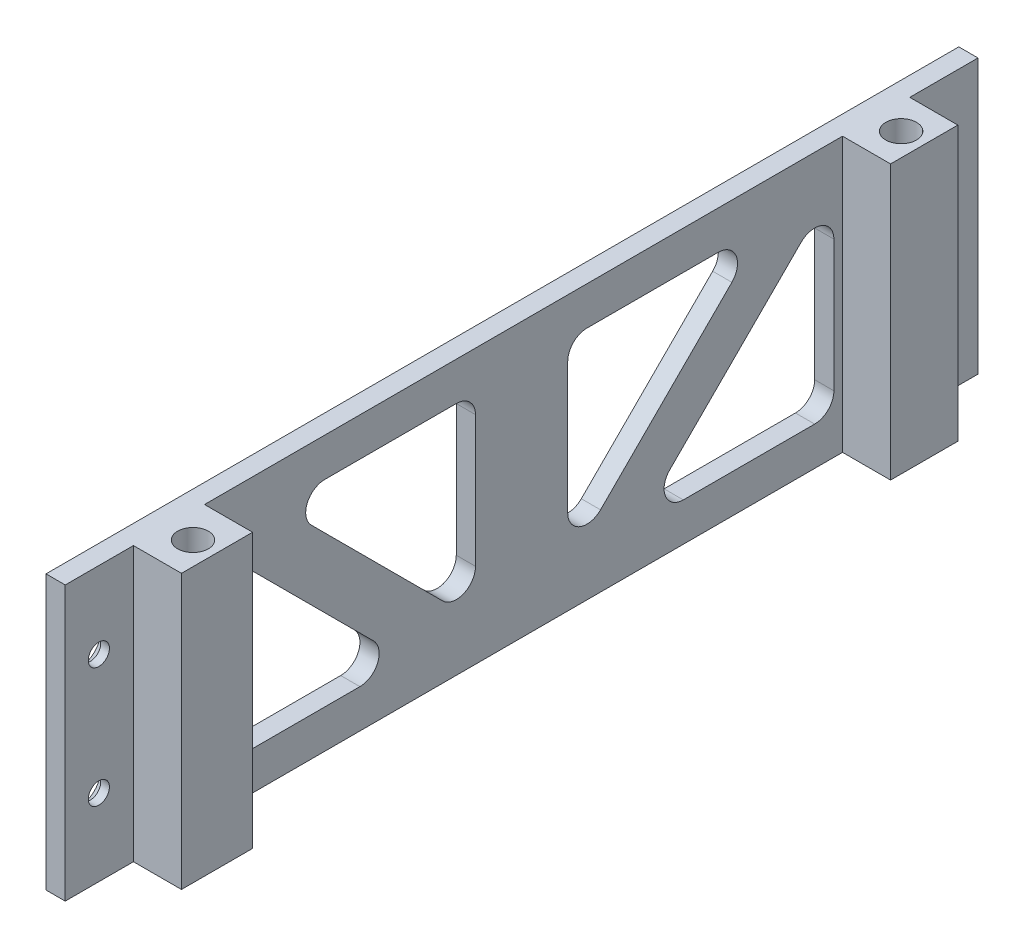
ISO-10303-21;
HEADER;
FILE_DESCRIPTION(('STEP AP214'),'2;1');
FILE_NAME('part.step','',(''),(''),'','','');
FILE_SCHEMA(('AUTOMOTIVE_DESIGN { 1 0 10303 214 1 1 1 1 }'));
ENDSEC;
DATA;
#1=APPLICATION_CONTEXT('core data for automotive mechanical design processes');
#2=APPLICATION_PROTOCOL_DEFINITION('international standard','automotive_design',2000,#1);
#3=PRODUCT_CONTEXT('',#1,'mechanical');
#4=PRODUCT('Part','Part','',(#3));
#5=PRODUCT_RELATED_PRODUCT_CATEGORY('part','',(#4));
#6=PRODUCT_DEFINITION_FORMATION('','',#4);
#7=PRODUCT_DEFINITION_CONTEXT('part definition',#1,'design');
#8=PRODUCT_DEFINITION('design','',#6,#7);
#9=PRODUCT_DEFINITION_SHAPE('','',#8);
#10=(LENGTH_UNIT() NAMED_UNIT(*) SI_UNIT(.MILLI.,.METRE.));
#11=(NAMED_UNIT(*) PLANE_ANGLE_UNIT() SI_UNIT($,.RADIAN.));
#12=(NAMED_UNIT(*) SI_UNIT($,.STERADIAN.) SOLID_ANGLE_UNIT());
#13=UNCERTAINTY_MEASURE_WITH_UNIT(LENGTH_MEASURE(1.E-05),#10,'distance_accuracy_value','');
#14=(GEOMETRIC_REPRESENTATION_CONTEXT(3) GLOBAL_UNCERTAINTY_ASSIGNED_CONTEXT((#13)) GLOBAL_UNIT_ASSIGNED_CONTEXT((#10,
#11,#12)) REPRESENTATION_CONTEXT('',''));
#15=CARTESIAN_POINT('',(0.,0.,0.));
#16=DIRECTION('',(0.,0.,1.));
#17=DIRECTION('',(1.,0.,0.));
#18=AXIS2_PLACEMENT_3D('',#15,#16,#17);
#19=CARTESIAN_POINT('',(2.,0.,0.));
#20=DIRECTION('',(-1.,0.,0.));
#21=DIRECTION('',(0.,0.,1.));
#22=AXIS2_PLACEMENT_3D('',#19,#20,#21);
#23=PLANE('',#22);
#24=CARTESIAN_POINT('',(2.,8.25000000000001,6.7999999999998));
#25=DIRECTION('',(-1.,0.,0.));
#26=DIRECTION('',(0.,0.,1.));
#27=AXIS2_PLACEMENT_3D('',#24,#25,#26);
#28=CIRCLE('',#27,2.);
#29=CARTESIAN_POINT('',(2.,8.25000000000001,4.7999999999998));
#30=VERTEX_POINT('',#29);
#31=CARTESIAN_POINT('',(2.,10.25,6.7999999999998));
#32=VERTEX_POINT('',#31);
#33=EDGE_CURVE('E358',#30,#32,#28,.F.);
#34=ORIENTED_EDGE('',*,*,#33,.F.);
#35=DIRECTION('',(0.,1.,0.));
#36=VECTOR('',#35,1.);
#37=CARTESIAN_POINT('',(2.,0.,4.79999999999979));
#38=LINE('',#37,#36);
#39=CARTESIAN_POINT('',(2.,-5.42157287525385,4.79999999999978));
#40=VERTEX_POINT('',#39);
#41=EDGE_CURVE('E337',#40,#30,#38,.T.);
#42=ORIENTED_EDGE('',*,*,#41,.F.);
#43=CARTESIAN_POINT('',(2.,-5.42157287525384,6.7999999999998));
#44=DIRECTION('',(-1.,0.,0.));
#45=DIRECTION('',(0.,0.,1.));
#46=AXIS2_PLACEMENT_3D('',#43,#44,#45);
#47=CIRCLE('',#46,2.00000000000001);
#48=CARTESIAN_POINT('',(2.,-6.83578643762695,8.21421356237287));
#49=VERTEX_POINT('',#48);
#50=EDGE_CURVE('E349',#49,#40,#47,.F.);
#51=ORIENTED_EDGE('',*,*,#50,.F.);
#52=DIRECTION('',(0.,-0.707106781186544,-0.707106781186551));
#53=VECTOR('',#52,1.);
#54=CARTESIAN_POINT('',(2.,-7.52499999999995,7.52499999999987));
#55=LINE('',#54,#53);
#56=CARTESIAN_POINT('',(2.,6.83578643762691,21.8857864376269));
#57=VERTEX_POINT('',#56);
#58=EDGE_CURVE('E352',#57,#49,#55,.T.);
#59=ORIENTED_EDGE('',*,*,#58,.F.);
#60=CARTESIAN_POINT('',(2.,8.25000000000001,20.4715728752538));
#61=DIRECTION('',(-1.,0.,0.));
#62=DIRECTION('',(0.,0.,1.));
#63=AXIS2_PLACEMENT_3D('',#60,#61,#62);
#64=CIRCLE('',#63,2.);
#65=CARTESIAN_POINT('',(2.,10.25,20.4715728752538));
#66=VERTEX_POINT('',#65);
#67=EDGE_CURVE('E354',#66,#57,#64,.F.);
#68=ORIENTED_EDGE('',*,*,#67,.F.);
#69=DIRECTION('',(0.,0.,1.));
#70=VECTOR('',#69,1.);
#71=CARTESIAN_POINT('',(2.,10.25,0.));
#72=LINE('',#71,#70);
#73=EDGE_CURVE('E356',#32,#66,#72,.T.);
#74=ORIENTED_EDGE('',*,*,#73,.F.);
#75=EDGE_LOOP('',(#34,#42,#51,#59,#68,#74));
#76=FACE_BOUND('',#75,.T.);
#77=DIRECTION('',(0.,0.,1.));
#78=VECTOR('',#77,1.);
#79=CARTESIAN_POINT('',(2.,-10.25,0.));
#80=LINE('',#79,#78);
#81=CARTESIAN_POINT('',(2.,-10.25,-30.5));
#82=VERTEX_POINT('',#81);
#83=CARTESIAN_POINT('',(2.,-10.25,-16.8284271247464));
#84=VERTEX_POINT('',#83);
#85=EDGE_CURVE('E402',#82,#84,#80,.T.);
#86=ORIENTED_EDGE('',*,*,#85,.T.);
#87=CARTESIAN_POINT('',(2.,-8.25,-16.8284271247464));
#88=DIRECTION('',(-1.,0.,0.));
#89=DIRECTION('',(0.,0.,1.));
#90=AXIS2_PLACEMENT_3D('',#87,#88,#89);
#91=CIRCLE('',#90,2.);
#92=CARTESIAN_POINT('',(2.,-6.83578643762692,-15.4142135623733));
#93=VERTEX_POINT('',#92);
#94=EDGE_CURVE('E405',#84,#93,#91,.T.);
#95=ORIENTED_EDGE('',*,*,#94,.T.);
#96=DIRECTION('',(0.,0.707106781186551,-0.707106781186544));
#97=VECTOR('',#96,1.);
#98=CARTESIAN_POINT('',(2.,-11.1250000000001,-11.1250000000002));
#99=LINE('',#98,#97);
#100=CARTESIAN_POINT('',(2.,6.83578643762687,-29.0857864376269));
#101=VERTEX_POINT('',#100);
#102=EDGE_CURVE('E380',#93,#101,#99,.T.);
#103=ORIENTED_EDGE('',*,*,#102,.T.);
#104=CARTESIAN_POINT('',(2.,5.42157287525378,-30.5));
#105=DIRECTION('',(-1.,0.,0.));
#106=DIRECTION('',(0.,0.,1.));
#107=AXIS2_PLACEMENT_3D('',#104,#105,#106);
#108=CIRCLE('',#107,2.);
#109=CARTESIAN_POINT('',(2.,5.42157287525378,-32.5));
#110=VERTEX_POINT('',#109);
#111=EDGE_CURVE('E393',#101,#110,#108,.T.);
#112=ORIENTED_EDGE('',*,*,#111,.T.);
#113=DIRECTION('',(0.,-1.,0.));
#114=VECTOR('',#113,1.);
#115=CARTESIAN_POINT('',(2.,0.,-32.5));
#116=LINE('',#115,#114);
#117=CARTESIAN_POINT('',(2.,-8.25,-32.5));
#118=VERTEX_POINT('',#117);
#119=EDGE_CURVE('E396',#110,#118,#116,.T.);
#120=ORIENTED_EDGE('',*,*,#119,.T.);
#121=CARTESIAN_POINT('',(2.,-8.25,-30.5));
#122=DIRECTION('',(-1.,0.,0.));
#123=DIRECTION('',(0.,0.,1.));
#124=AXIS2_PLACEMENT_3D('',#121,#122,#123);
#125=CIRCLE('',#124,2.);
#126=EDGE_CURVE('E399',#118,#82,#125,.T.);
#127=ORIENTED_EDGE('',*,*,#126,.T.);
#128=EDGE_LOOP('',(#86,#95,#103,#112,#120,#127));
#129=FACE_BOUND('',#128,.T.);
#130=DIRECTION('',(0.,1.,0.));
#131=VECTOR('',#130,1.);
#132=CARTESIAN_POINT('',(2.,0.,-4.79999999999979));
#133=LINE('',#132,#131);
#134=CARTESIAN_POINT('',(2.,-5.42157287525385,-4.79999999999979));
#135=VERTEX_POINT('',#134);
#136=CARTESIAN_POINT('',(2.,8.25000000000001,-4.7999999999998));
#137=VERTEX_POINT('',#136);
#138=EDGE_CURVE('E450',#135,#137,#133,.T.);
#139=ORIENTED_EDGE('',*,*,#138,.T.);
#140=CARTESIAN_POINT('',(2.,8.25000000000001,-6.7999999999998));
#141=DIRECTION('',(-1.,0.,0.));
#142=DIRECTION('',(0.,0.,1.));
#143=AXIS2_PLACEMENT_3D('',#140,#141,#142);
#144=CIRCLE('',#143,2.);
#145=CARTESIAN_POINT('',(2.,10.25,-6.7999999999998));
#146=VERTEX_POINT('',#145);
#147=EDGE_CURVE('E453',#137,#146,#144,.T.);
#148=ORIENTED_EDGE('',*,*,#147,.T.);
#149=DIRECTION('',(0.,0.,-1.));
#150=VECTOR('',#149,1.);
#151=CARTESIAN_POINT('',(2.,10.25,0.));
#152=LINE('',#151,#150);
#153=CARTESIAN_POINT('',(2.,10.25,-20.4715728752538));
#154=VERTEX_POINT('',#153);
#155=EDGE_CURVE('E428',#146,#154,#152,.T.);
#156=ORIENTED_EDGE('',*,*,#155,.T.);
#157=CARTESIAN_POINT('',(2.,8.25000000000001,-20.4715728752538));
#158=DIRECTION('',(-1.,0.,0.));
#159=DIRECTION('',(0.,0.,1.));
#160=AXIS2_PLACEMENT_3D('',#157,#158,#159);
#161=CIRCLE('',#160,2.);
#162=CARTESIAN_POINT('',(2.,6.83578643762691,-21.8857864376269));
#163=VERTEX_POINT('',#162);
#164=EDGE_CURVE('E441',#154,#163,#161,.T.);
#165=ORIENTED_EDGE('',*,*,#164,.T.);
#166=DIRECTION('',(0.,-0.707106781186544,0.707106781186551));
#167=VECTOR('',#166,1.);
#168=CARTESIAN_POINT('',(2.,-7.52499999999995,-7.52499999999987));
#169=LINE('',#168,#167);
#170=CARTESIAN_POINT('',(2.,-6.83578643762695,-8.21421356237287));
#171=VERTEX_POINT('',#170);
#172=EDGE_CURVE('E444',#163,#171,#169,.T.);
#173=ORIENTED_EDGE('',*,*,#172,.T.);
#174=CARTESIAN_POINT('',(2.,-5.42157287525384,-6.7999999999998));
#175=DIRECTION('',(-1.,0.,0.));
#176=DIRECTION('',(0.,0.,1.));
#177=AXIS2_PLACEMENT_3D('',#174,#175,#176);
#178=CIRCLE('',#177,2.00000000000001);
#179=EDGE_CURVE('E447',#171,#135,#178,.T.);
#180=ORIENTED_EDGE('',*,*,#179,.T.);
#181=EDGE_LOOP('',(#139,#148,#156,#165,#173,#180));
#182=FACE_BOUND('',#181,.T.);
#183=DIRECTION('',(0.,-1.,0.));
#184=VECTOR('',#183,1.);
#185=CARTESIAN_POINT('',(2.,14.25,-33.4));
#186=LINE('',#185,#184);
#187=CARTESIAN_POINT('',(2.,14.25,-33.4));
#188=VERTEX_POINT('',#187);
#189=CARTESIAN_POINT('',(2.,-14.25,-33.4));
#190=VERTEX_POINT('',#189);
#191=EDGE_CURVE('E505',#188,#190,#186,.T.);
#192=ORIENTED_EDGE('',*,*,#191,.F.);
#193=DIRECTION('',(0.,0.,1.));
#194=VECTOR('',#193,1.);
#195=CARTESIAN_POINT('',(2.,14.25,-47.5));
#196=LINE('',#195,#194);
#197=CARTESIAN_POINT('',(2.,14.25,33.));
#198=VERTEX_POINT('',#197);
#199=EDGE_CURVE('E555',#188,#198,#196,.T.);
#200=ORIENTED_EDGE('',*,*,#199,.T.);
#201=DIRECTION('',(0.,1.,0.));
#202=VECTOR('',#201,1.);
#203=CARTESIAN_POINT('',(2.,-14.25,33.));
#204=LINE('',#203,#202);
#205=CARTESIAN_POINT('',(2.,-14.25,33.));
#206=VERTEX_POINT('',#205);
#207=EDGE_CURVE('E533',#206,#198,#204,.T.);
#208=ORIENTED_EDGE('',*,*,#207,.F.);
#209=DIRECTION('',(0.,0.,-1.));
#210=VECTOR('',#209,1.);
#211=CARTESIAN_POINT('',(2.,-14.25,-47.5));
#212=LINE('',#211,#210);
#213=EDGE_CURVE('E574',#206,#190,#212,.T.);
#214=ORIENTED_EDGE('',*,*,#213,.T.);
#215=EDGE_LOOP('',(#192,#200,#208,#214));
#216=FACE_BOUND('',#215,.T.);
#217=CARTESIAN_POINT('',(2.,-8.25,16.8284271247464));
#218=DIRECTION('',(-1.,0.,0.));
#219=DIRECTION('',(0.,0.,1.));
#220=AXIS2_PLACEMENT_3D('',#217,#218,#219);
#221=CIRCLE('',#220,2.);
#222=CARTESIAN_POINT('',(2.,-10.25,16.8284271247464));
#223=VERTEX_POINT('',#222);
#224=CARTESIAN_POINT('',(2.,-6.83578643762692,15.4142135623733));
#225=VERTEX_POINT('',#224);
#226=EDGE_CURVE('E314',#223,#225,#221,.F.);
#227=ORIENTED_EDGE('',*,*,#226,.F.);
#228=DIRECTION('',(0.,0.,-1.));
#229=VECTOR('',#228,1.);
#230=CARTESIAN_POINT('',(2.,-10.25,0.));
#231=LINE('',#230,#229);
#232=CARTESIAN_POINT('',(2.,-10.25,30.5));
#233=VERTEX_POINT('',#232);
#234=EDGE_CURVE('E299',#233,#223,#231,.T.);
#235=ORIENTED_EDGE('',*,*,#234,.F.);
#236=CARTESIAN_POINT('',(2.,-8.25,30.5));
#237=DIRECTION('',(-1.,0.,0.));
#238=DIRECTION('',(0.,0.,1.));
#239=AXIS2_PLACEMENT_3D('',#236,#237,#238);
#240=CIRCLE('',#239,2.);
#241=CARTESIAN_POINT('',(2.,-8.25,32.5));
#242=VERTEX_POINT('',#241);
#243=EDGE_CURVE('E274',#242,#233,#240,.F.);
#244=ORIENTED_EDGE('',*,*,#243,.F.);
#245=DIRECTION('',(0.,-1.,0.));
#246=VECTOR('',#245,1.);
#247=CARTESIAN_POINT('',(2.,0.,32.5));
#248=LINE('',#247,#246);
#249=CARTESIAN_POINT('',(2.,5.42157287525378,32.5));
#250=VERTEX_POINT('',#249);
#251=EDGE_CURVE('E308',#250,#242,#248,.T.);
#252=ORIENTED_EDGE('',*,*,#251,.F.);
#253=CARTESIAN_POINT('',(2.,5.42157287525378,30.5));
#254=DIRECTION('',(-1.,0.,0.));
#255=DIRECTION('',(0.,0.,1.));
#256=AXIS2_PLACEMENT_3D('',#253,#254,#255);
#257=CIRCLE('',#256,2.);
#258=CARTESIAN_POINT('',(2.,6.83578643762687,29.0857864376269));
#259=VERTEX_POINT('',#258);
#260=EDGE_CURVE('E310',#259,#250,#257,.F.);
#261=ORIENTED_EDGE('',*,*,#260,.F.);
#262=DIRECTION('',(0.,0.707106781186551,0.707106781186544));
#263=VECTOR('',#262,1.);
#264=CARTESIAN_POINT('',(2.,-11.1250000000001,11.1250000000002));
#265=LINE('',#264,#263);
#266=EDGE_CURVE('E312',#225,#259,#265,.T.);
#267=ORIENTED_EDGE('',*,*,#266,.F.);
#268=EDGE_LOOP('',(#227,#235,#244,#252,#261,#267));
#269=FACE_BOUND('',#268,.T.);
#270=ADVANCED_FACE('F33',(#76,#129,#182,#216,#269),#23,.F.);
#271=CARTESIAN_POINT('',(0.,0.,0.));
#272=DIRECTION('',(-1.,0.,0.));
#273=DIRECTION('',(0.,0.,1.));
#274=AXIS2_PLACEMENT_3D('',#271,#272,#273);
#275=PLANE('',#274);
#276=DIRECTION('',(0.,1.,0.));
#277=VECTOR('',#276,1.);
#278=CARTESIAN_POINT('',(0.,8.25000000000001,4.7999999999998));
#279=LINE('',#278,#277);
#280=CARTESIAN_POINT('',(0.,-5.42157287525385,4.79999999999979));
#281=VERTEX_POINT('',#280);
#282=CARTESIAN_POINT('',(0.,8.25000000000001,4.7999999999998));
#283=VERTEX_POINT('',#282);
#284=EDGE_CURVE('E319',#281,#283,#279,.T.);
#285=ORIENTED_EDGE('',*,*,#284,.T.);
#286=CARTESIAN_POINT('',(0.,8.25000000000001,6.7999999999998));
#287=DIRECTION('',(1.,0.,0.));
#288=DIRECTION('',(0.,0.,1.));
#289=AXIS2_PLACEMENT_3D('',#286,#287,#288);
#290=CIRCLE('',#289,2.);
#291=CARTESIAN_POINT('',(0.,10.25,6.7999999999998));
#292=VERTEX_POINT('',#291);
#293=EDGE_CURVE('E316',#283,#292,#290,.T.);
#294=ORIENTED_EDGE('',*,*,#293,.T.);
#295=DIRECTION('',(0.,0.,1.));
#296=VECTOR('',#295,1.);
#297=CARTESIAN_POINT('',(0.,10.25,20.4715728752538));
#298=LINE('',#297,#296);
#299=CARTESIAN_POINT('',(0.,10.25,20.4715728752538));
#300=VERTEX_POINT('',#299);
#301=EDGE_CURVE('E331',#292,#300,#298,.T.);
#302=ORIENTED_EDGE('',*,*,#301,.T.);
#303=CARTESIAN_POINT('',(0.,8.25000000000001,20.4715728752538));
#304=DIRECTION('',(1.,0.,0.));
#305=DIRECTION('',(0.,0.,-1.));
#306=AXIS2_PLACEMENT_3D('',#303,#304,#305);
#307=CIRCLE('',#306,2.);
#308=CARTESIAN_POINT('',(0.,6.83578643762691,21.8857864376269));
#309=VERTEX_POINT('',#308);
#310=EDGE_CURVE('E328',#300,#309,#307,.T.);
#311=ORIENTED_EDGE('',*,*,#310,.T.);
#312=DIRECTION('',(0.,-0.707106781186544,-0.707106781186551));
#313=VECTOR('',#312,1.);
#314=CARTESIAN_POINT('',(0.,-6.83578643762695,8.21421356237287));
#315=LINE('',#314,#313);
#316=CARTESIAN_POINT('',(0.,-6.83578643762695,8.21421356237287));
#317=VERTEX_POINT('',#316);
#318=EDGE_CURVE('E325',#309,#317,#315,.T.);
#319=ORIENTED_EDGE('',*,*,#318,.T.);
#320=CARTESIAN_POINT('',(0.,-5.42157287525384,6.7999999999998));
#321=DIRECTION('',(1.,0.,0.));
#322=DIRECTION('',(0.,0.,1.));
#323=AXIS2_PLACEMENT_3D('',#320,#321,#322);
#324=CIRCLE('',#323,2.00000000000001);
#325=EDGE_CURVE('E322',#317,#281,#324,.T.);
#326=ORIENTED_EDGE('',*,*,#325,.T.);
#327=EDGE_LOOP('',(#285,#294,#302,#311,#319,#326));
#328=FACE_BOUND('',#327,.T.);
#329=CARTESIAN_POINT('',(0.,-8.25,-16.8284271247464));
#330=DIRECTION('',(-1.,0.,0.));
#331=DIRECTION('',(0.,0.,1.));
#332=AXIS2_PLACEMENT_3D('',#329,#330,#331);
#333=CIRCLE('',#332,2.);
#334=CARTESIAN_POINT('',(0.,-10.25,-16.8284271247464));
#335=VERTEX_POINT('',#334);
#336=CARTESIAN_POINT('',(0.,-6.83578643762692,-15.4142135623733));
#337=VERTEX_POINT('',#336);
#338=EDGE_CURVE('E360',#335,#337,#333,.T.);
#339=ORIENTED_EDGE('',*,*,#338,.F.);
#340=DIRECTION('',(0.,0.,1.));
#341=VECTOR('',#340,1.);
#342=CARTESIAN_POINT('',(0.,-10.25,-30.5));
#343=LINE('',#342,#341);
#344=CARTESIAN_POINT('',(0.,-10.25,-30.5));
#345=VERTEX_POINT('',#344);
#346=EDGE_CURVE('E374',#345,#335,#343,.T.);
#347=ORIENTED_EDGE('',*,*,#346,.F.);
#348=CARTESIAN_POINT('',(0.,-8.25,-30.5));
#349=DIRECTION('',(-1.,0.,0.));
#350=DIRECTION('',(0.,0.,1.));
#351=AXIS2_PLACEMENT_3D('',#348,#349,#350);
#352=CIRCLE('',#351,2.);
#353=CARTESIAN_POINT('',(0.,-8.25,-32.5));
#354=VERTEX_POINT('',#353);
#355=EDGE_CURVE('E371',#354,#345,#352,.T.);
#356=ORIENTED_EDGE('',*,*,#355,.F.);
#357=DIRECTION('',(0.,-1.,0.));
#358=VECTOR('',#357,1.);
#359=CARTESIAN_POINT('',(0.,5.42157287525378,-32.5));
#360=LINE('',#359,#358);
#361=CARTESIAN_POINT('',(0.,5.42157287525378,-32.5));
#362=VERTEX_POINT('',#361);
#363=EDGE_CURVE('E368',#362,#354,#360,.T.);
#364=ORIENTED_EDGE('',*,*,#363,.F.);
#365=CARTESIAN_POINT('',(0.,5.42157287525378,-30.5));
#366=DIRECTION('',(-1.,0.,0.));
#367=DIRECTION('',(0.,0.,-1.));
#368=AXIS2_PLACEMENT_3D('',#365,#366,#367);
#369=CIRCLE('',#368,2.);
#370=CARTESIAN_POINT('',(0.,6.83578643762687,-29.0857864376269));
#371=VERTEX_POINT('',#370);
#372=EDGE_CURVE('E365',#371,#362,#369,.T.);
#373=ORIENTED_EDGE('',*,*,#372,.F.);
#374=DIRECTION('',(0.,0.707106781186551,-0.707106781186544));
#375=VECTOR('',#374,1.);
#376=CARTESIAN_POINT('',(0.,-6.83578643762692,-15.4142135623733));
#377=LINE('',#376,#375);
#378=EDGE_CURVE('E362',#337,#371,#377,.T.);
#379=ORIENTED_EDGE('',*,*,#378,.F.);
#380=EDGE_LOOP('',(#339,#347,#356,#364,#373,#379));
#381=FACE_BOUND('',#380,.T.);
#382=CARTESIAN_POINT('',(0.,8.25000000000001,-6.7999999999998));
#383=DIRECTION('',(-1.,0.,0.));
#384=DIRECTION('',(0.,0.,-1.));
#385=AXIS2_PLACEMENT_3D('',#382,#383,#384);
#386=CIRCLE('',#385,2.);
#387=CARTESIAN_POINT('',(0.,8.25000000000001,-4.7999999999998));
#388=VERTEX_POINT('',#387);
#389=CARTESIAN_POINT('',(0.,10.25,-6.7999999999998));
#390=VERTEX_POINT('',#389);
#391=EDGE_CURVE('E408',#388,#390,#386,.T.);
#392=ORIENTED_EDGE('',*,*,#391,.F.);
#393=DIRECTION('',(0.,1.,0.));
#394=VECTOR('',#393,1.);
#395=CARTESIAN_POINT('',(0.,8.25000000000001,-4.7999999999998));
#396=LINE('',#395,#394);
#397=CARTESIAN_POINT('',(0.,-5.42157287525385,-4.79999999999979));
#398=VERTEX_POINT('',#397);
#399=EDGE_CURVE('E422',#398,#388,#396,.T.);
#400=ORIENTED_EDGE('',*,*,#399,.F.);
#401=CARTESIAN_POINT('',(0.,-5.42157287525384,-6.7999999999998));
#402=DIRECTION('',(-1.,0.,0.));
#403=DIRECTION('',(0.,0.,-1.));
#404=AXIS2_PLACEMENT_3D('',#401,#402,#403);
#405=CIRCLE('',#404,2.00000000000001);
#406=CARTESIAN_POINT('',(0.,-6.83578643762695,-8.21421356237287));
#407=VERTEX_POINT('',#406);
#408=EDGE_CURVE('E419',#407,#398,#405,.T.);
#409=ORIENTED_EDGE('',*,*,#408,.F.);
#410=DIRECTION('',(0.,-0.707106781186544,0.707106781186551));
#411=VECTOR('',#410,1.);
#412=CARTESIAN_POINT('',(0.,-6.83578643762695,-8.21421356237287));
#413=LINE('',#412,#411);
#414=CARTESIAN_POINT('',(0.,6.83578643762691,-21.8857864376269));
#415=VERTEX_POINT('',#414);
#416=EDGE_CURVE('E416',#415,#407,#413,.T.);
#417=ORIENTED_EDGE('',*,*,#416,.F.);
#418=CARTESIAN_POINT('',(0.,8.25000000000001,-20.4715728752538));
#419=DIRECTION('',(-1.,0.,0.));
#420=DIRECTION('',(0.,0.,1.));
#421=AXIS2_PLACEMENT_3D('',#418,#419,#420);
#422=CIRCLE('',#421,2.);
#423=CARTESIAN_POINT('',(0.,10.25,-20.4715728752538));
#424=VERTEX_POINT('',#423);
#425=EDGE_CURVE('E413',#424,#415,#422,.T.);
#426=ORIENTED_EDGE('',*,*,#425,.F.);
#427=DIRECTION('',(0.,0.,-1.));
#428=VECTOR('',#427,1.);
#429=CARTESIAN_POINT('',(0.,10.25,-20.4715728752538));
#430=LINE('',#429,#428);
#431=EDGE_CURVE('E410',#390,#424,#430,.T.);
#432=ORIENTED_EDGE('',*,*,#431,.F.);
#433=EDGE_LOOP('',(#392,#400,#409,#417,#426,#432));
#434=FACE_BOUND('',#433,.T.);
#435=CARTESIAN_POINT('',(0.,6.25000000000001,-44.));
#436=DIRECTION('',(-1.,0.,0.));
#437=DIRECTION('',(0.,0.,1.));
#438=AXIS2_PLACEMENT_3D('',#435,#436,#437);
#439=CIRCLE('',#438,2.2);
#440=CARTESIAN_POINT('',(0.,6.25000000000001,-41.8));
#441=VERTEX_POINT('',#440);
#442=EDGE_CURVE('E456',#441,#441,#439,.T.);
#443=ORIENTED_EDGE('',*,*,#442,.F.);
#444=EDGE_LOOP('',(#443));
#445=FACE_BOUND('',#444,.T.);
#446=CARTESIAN_POINT('',(0.,-6.25,-44.));
#447=DIRECTION('',(-1.,0.,0.));
#448=DIRECTION('',(0.,0.,1.));
#449=AXIS2_PLACEMENT_3D('',#446,#447,#448);
#450=CIRCLE('',#449,2.2);
#451=CARTESIAN_POINT('',(0.,-6.25,-41.8));
#452=VERTEX_POINT('',#451);
#453=EDGE_CURVE('E465',#452,#452,#450,.T.);
#454=ORIENTED_EDGE('',*,*,#453,.F.);
#455=EDGE_LOOP('',(#454));
#456=FACE_BOUND('',#455,.T.);
#457=CARTESIAN_POINT('',(0.,6.25000000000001,44.));
#458=DIRECTION('',(-1.,0.,0.));
#459=DIRECTION('',(0.,0.,1.));
#460=AXIS2_PLACEMENT_3D('',#457,#458,#459);
#461=CIRCLE('',#460,2.2);
#462=CARTESIAN_POINT('',(0.,6.25000000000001,46.2));
#463=VERTEX_POINT('',#462);
#464=EDGE_CURVE('E474',#463,#463,#461,.T.);
#465=ORIENTED_EDGE('',*,*,#464,.F.);
#466=EDGE_LOOP('',(#465));
#467=FACE_BOUND('',#466,.T.);
#468=CARTESIAN_POINT('',(0.,-6.25,44.));
#469=DIRECTION('',(-1.,0.,0.));
#470=DIRECTION('',(0.,0.,1.));
#471=AXIS2_PLACEMENT_3D('',#468,#469,#470);
#472=CIRCLE('',#471,2.2);
#473=CARTESIAN_POINT('',(0.,-6.25,46.2));
#474=VERTEX_POINT('',#473);
#475=EDGE_CURVE('E483',#474,#474,#472,.T.);
#476=ORIENTED_EDGE('',*,*,#475,.F.);
#477=EDGE_LOOP('',(#476));
#478=FACE_BOUND('',#477,.T.);
#479=DIRECTION('',(0.,-1.,0.));
#480=VECTOR('',#479,1.);
#481=CARTESIAN_POINT('',(0.,14.25,47.5));
#482=LINE('',#481,#480);
#483=CARTESIAN_POINT('',(0.,14.25,47.5));
#484=VERTEX_POINT('',#483);
#485=CARTESIAN_POINT('',(0.,-14.25,47.5));
#486=VERTEX_POINT('',#485);
#487=EDGE_CURVE('E565',#484,#486,#482,.T.);
#488=ORIENTED_EDGE('',*,*,#487,.F.);
#489=DIRECTION('',(0.,0.,1.));
#490=VECTOR('',#489,1.);
#491=CARTESIAN_POINT('',(0.,14.25,-47.5));
#492=LINE('',#491,#490);
#493=CARTESIAN_POINT('',(0.,14.25,-47.5));
#494=VERTEX_POINT('',#493);
#495=EDGE_CURVE('E582',#494,#484,#492,.T.);
#496=ORIENTED_EDGE('',*,*,#495,.F.);
#497=DIRECTION('',(0.,1.,0.));
#498=VECTOR('',#497,1.);
#499=CARTESIAN_POINT('',(0.,14.25,-47.5));
#500=LINE('',#499,#498);
#501=CARTESIAN_POINT('',(0.,-14.25,-47.5));
#502=VERTEX_POINT('',#501);
#503=EDGE_CURVE('E586',#502,#494,#500,.T.);
#504=ORIENTED_EDGE('',*,*,#503,.F.);
#505=DIRECTION('',(0.,0.,-1.));
#506=VECTOR('',#505,1.);
#507=CARTESIAN_POINT('',(0.,-14.25,-47.5));
#508=LINE('',#507,#506);
#509=EDGE_CURVE('E593',#486,#502,#508,.T.);
#510=ORIENTED_EDGE('',*,*,#509,.F.);
#511=EDGE_LOOP('',(#488,#496,#504,#510));
#512=FACE_BOUND('',#511,.T.);
#513=DIRECTION('',(0.,0.,-1.));
#514=VECTOR('',#513,1.);
#515=CARTESIAN_POINT('',(0.,-10.25,30.5));
#516=LINE('',#515,#514);
#517=CARTESIAN_POINT('',(0.,-10.25,30.5));
#518=VERTEX_POINT('',#517);
#519=CARTESIAN_POINT('',(0.,-10.25,16.8284271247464));
#520=VERTEX_POINT('',#519);
#521=EDGE_CURVE('E280',#518,#520,#516,.T.);
#522=ORIENTED_EDGE('',*,*,#521,.T.);
#523=CARTESIAN_POINT('',(0.,-8.25,16.8284271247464));
#524=DIRECTION('',(1.,0.,0.));
#525=DIRECTION('',(0.,0.,-1.));
#526=AXIS2_PLACEMENT_3D('',#523,#524,#525);
#527=CIRCLE('',#526,2.);
#528=CARTESIAN_POINT('',(0.,-6.83578643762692,15.4142135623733));
#529=VERTEX_POINT('',#528);
#530=EDGE_CURVE('E58',#520,#529,#527,.T.);
#531=ORIENTED_EDGE('',*,*,#530,.T.);
#532=DIRECTION('',(0.,0.707106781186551,0.707106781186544));
#533=VECTOR('',#532,1.);
#534=CARTESIAN_POINT('',(0.,-6.83578643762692,15.4142135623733));
#535=LINE('',#534,#533);
#536=CARTESIAN_POINT('',(0.,6.83578643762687,29.0857864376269));
#537=VERTEX_POINT('',#536);
#538=EDGE_CURVE('E294',#529,#537,#535,.T.);
#539=ORIENTED_EDGE('',*,*,#538,.T.);
#540=CARTESIAN_POINT('',(0.,5.42157287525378,30.5));
#541=DIRECTION('',(1.,0.,0.));
#542=DIRECTION('',(0.,0.,1.));
#543=AXIS2_PLACEMENT_3D('',#540,#541,#542);
#544=CIRCLE('',#543,2.);
#545=CARTESIAN_POINT('',(0.,5.42157287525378,32.5));
#546=VERTEX_POINT('',#545);
#547=EDGE_CURVE('E289',#537,#546,#544,.T.);
#548=ORIENTED_EDGE('',*,*,#547,.T.);
#549=DIRECTION('',(0.,-1.,0.));
#550=VECTOR('',#549,1.);
#551=CARTESIAN_POINT('',(0.,5.42157287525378,32.5));
#552=LINE('',#551,#550);
#553=CARTESIAN_POINT('',(0.,-8.25,32.5));
#554=VERTEX_POINT('',#553);
#555=EDGE_CURVE('E287',#546,#554,#552,.T.);
#556=ORIENTED_EDGE('',*,*,#555,.T.);
#557=CARTESIAN_POINT('',(0.,-8.25,30.5));
#558=DIRECTION('',(1.,0.,0.));
#559=DIRECTION('',(0.,0.,-1.));
#560=AXIS2_PLACEMENT_3D('',#557,#558,#559);
#561=CIRCLE('',#560,2.);
#562=EDGE_CURVE('E271',#554,#518,#561,.T.);
#563=ORIENTED_EDGE('',*,*,#562,.T.);
#564=EDGE_LOOP('',(#522,#531,#539,#548,#556,#563));
#565=FACE_BOUND('',#564,.T.);
#566=ADVANCED_FACE('F284',(#328,#381,#434,#445,#456,#467,#478,#512,#565),#275,.T.);
#567=CARTESIAN_POINT('',(2.,6.25000000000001,-44.));
#568=DIRECTION('',(-1.,0.,0.));
#569=DIRECTION('',(0.,0.,1.));
#570=AXIS2_PLACEMENT_3D('',#567,#568,#569);
#571=CIRCLE('',#570,1.09999999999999);
#572=CARTESIAN_POINT('',(2.,6.25000000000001,-42.9));
#573=VERTEX_POINT('',#572);
#574=EDGE_CURVE('E462',#573,#573,#571,.T.);
#575=ORIENTED_EDGE('',*,*,#574,.T.);
#576=EDGE_LOOP('',(#575));
#577=FACE_BOUND('',#576,.T.);
#578=CARTESIAN_POINT('',(2.,-6.25,-44.));
#579=DIRECTION('',(-1.,0.,0.));
#580=DIRECTION('',(0.,0.,1.));
#581=AXIS2_PLACEMENT_3D('',#578,#579,#580);
#582=CIRCLE('',#581,1.09999999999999);
#583=CARTESIAN_POINT('',(2.,-6.25,-42.9));
#584=VERTEX_POINT('',#583);
#585=EDGE_CURVE('E471',#584,#584,#582,.T.);
#586=ORIENTED_EDGE('',*,*,#585,.T.);
#587=EDGE_LOOP('',(#586));
#588=FACE_BOUND('',#587,.T.);
#589=DIRECTION('',(0.,1.,0.));
#590=VECTOR('',#589,1.);
#591=CARTESIAN_POINT('',(2.,14.25,-40.4));
#592=LINE('',#591,#590);
#593=CARTESIAN_POINT('',(2.,-14.25,-40.4));
#594=VERTEX_POINT('',#593);
#595=CARTESIAN_POINT('',(2.,14.25,-40.4));
#596=VERTEX_POINT('',#595);
#597=EDGE_CURVE('E512',#594,#596,#592,.T.);
#598=ORIENTED_EDGE('',*,*,#597,.F.);
#599=CARTESIAN_POINT('',(2.,-14.25,-47.5));
#600=VERTEX_POINT('',#599);
#601=EDGE_CURVE('E559',#594,#600,#212,.T.);
#602=ORIENTED_EDGE('',*,*,#601,.T.);
#603=DIRECTION('',(0.,1.,0.));
#604=VECTOR('',#603,1.);
#605=CARTESIAN_POINT('',(2.,14.25,-47.5));
#606=LINE('',#605,#604);
#607=CARTESIAN_POINT('',(2.,14.25,-47.5));
#608=VERTEX_POINT('',#607);
#609=EDGE_CURVE('E564',#600,#608,#606,.T.);
#610=ORIENTED_EDGE('',*,*,#609,.T.);
#611=EDGE_CURVE('E557',#608,#596,#196,.T.);
#612=ORIENTED_EDGE('',*,*,#611,.T.);
#613=EDGE_LOOP('',(#598,#602,#610,#612));
#614=FACE_BOUND('',#613,.T.);
#615=ADVANCED_FACE('F657',(#577,#588,#614),#23,.F.);
#616=CARTESIAN_POINT('',(2.,6.25000000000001,44.));
#617=DIRECTION('',(-1.,0.,0.));
#618=DIRECTION('',(0.,0.,1.));
#619=AXIS2_PLACEMENT_3D('',#616,#617,#618);
#620=CIRCLE('',#619,1.09999999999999);
#621=CARTESIAN_POINT('',(2.,6.25000000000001,45.1));
#622=VERTEX_POINT('',#621);
#623=EDGE_CURVE('E480',#622,#622,#620,.T.);
#624=ORIENTED_EDGE('',*,*,#623,.T.);
#625=EDGE_LOOP('',(#624));
#626=FACE_BOUND('',#625,.T.);
#627=CARTESIAN_POINT('',(2.,-6.25,44.));
#628=DIRECTION('',(-1.,0.,0.));
#629=DIRECTION('',(0.,0.,1.));
#630=AXIS2_PLACEMENT_3D('',#627,#628,#629);
#631=CIRCLE('',#630,1.09999999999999);
#632=CARTESIAN_POINT('',(2.,-6.25,45.1));
#633=VERTEX_POINT('',#632);
#634=EDGE_CURVE('E489',#633,#633,#631,.T.);
#635=ORIENTED_EDGE('',*,*,#634,.T.);
#636=EDGE_LOOP('',(#635));
#637=FACE_BOUND('',#636,.T.);
#638=DIRECTION('',(0.,-1.,0.));
#639=VECTOR('',#638,1.);
#640=CARTESIAN_POINT('',(2.,-14.25,40.4));
#641=LINE('',#640,#639);
#642=CARTESIAN_POINT('',(2.,14.25,40.4));
#643=VERTEX_POINT('',#642);
#644=CARTESIAN_POINT('',(2.,-14.25,40.4));
#645=VERTEX_POINT('',#644);
#646=EDGE_CURVE('E528',#643,#645,#641,.T.);
#647=ORIENTED_EDGE('',*,*,#646,.F.);
#648=CARTESIAN_POINT('',(2.,14.25,47.5));
#649=VERTEX_POINT('',#648);
#650=EDGE_CURVE('E558',#643,#649,#196,.T.);
#651=ORIENTED_EDGE('',*,*,#650,.T.);
#652=DIRECTION('',(0.,-1.,0.));
#653=VECTOR('',#652,1.);
#654=CARTESIAN_POINT('',(2.,14.25,47.5));
#655=LINE('',#654,#653);
#656=CARTESIAN_POINT('',(2.,-14.25,47.5));
#657=VERTEX_POINT('',#656);
#658=EDGE_CURVE('E578',#649,#657,#655,.T.);
#659=ORIENTED_EDGE('',*,*,#658,.T.);
#660=EDGE_CURVE('E576',#657,#645,#212,.T.);
#661=ORIENTED_EDGE('',*,*,#660,.T.);
#662=EDGE_LOOP('',(#647,#651,#659,#661));
#663=FACE_BOUND('',#662,.T.);
#664=ADVANCED_FACE('F658',(#626,#637,#663),#23,.F.);
#665=CARTESIAN_POINT('',(2.,14.25,47.5));
#666=DIRECTION('',(0.,0.,-1.));
#667=DIRECTION('',(0.,1.,0.));
#668=AXIS2_PLACEMENT_3D('',#665,#666,#667);
#669=PLANE('',#668);
#670=ORIENTED_EDGE('',*,*,#487,.T.);
#671=DIRECTION('',(-1.,0.,0.));
#672=VECTOR('',#671,1.);
#673=CARTESIAN_POINT('',(2.,-14.25,47.5));
#674=LINE('',#673,#672);
#675=EDGE_CURVE('E11',#657,#486,#674,.T.);
#676=ORIENTED_EDGE('',*,*,#675,.F.);
#677=ORIENTED_EDGE('',*,*,#658,.F.);
#678=DIRECTION('',(-1.,0.,0.));
#679=VECTOR('',#678,1.);
#680=CARTESIAN_POINT('',(2.,14.25,47.5));
#681=LINE('',#680,#679);
#682=EDGE_CURVE('E573',#649,#484,#681,.T.);
#683=ORIENTED_EDGE('',*,*,#682,.T.);
#684=EDGE_LOOP('',(#670,#676,#677,#683));
#685=FACE_BOUND('',#684,.T.);
#686=ADVANCED_FACE('F35',(#685),#669,.F.);
#687=CARTESIAN_POINT('',(2.,-14.25,-47.5));
#688=DIRECTION('',(0.,1.,0.));
#689=DIRECTION('',(0.,0.,1.));
#690=AXIS2_PLACEMENT_3D('',#687,#688,#689);
#691=PLANE('',#690);
#692=CARTESIAN_POINT('',(4.6,-14.25,-36.9));
#693=DIRECTION('',(0.,1.,0.));
#694=DIRECTION('',(0.,0.,1.));
#695=AXIS2_PLACEMENT_3D('',#692,#693,#694);
#696=CIRCLE('',#695,1.59999999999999);
#697=CARTESIAN_POINT('',(4.6,-14.25,-35.3));
#698=VERTEX_POINT('',#697);
#699=EDGE_CURVE('E495',#698,#698,#696,.T.);
#700=ORIENTED_EDGE('',*,*,#699,.T.);
#701=EDGE_LOOP('',(#700));
#702=FACE_BOUND('',#701,.T.);
#703=CARTESIAN_POINT('',(4.6,-14.25,36.8));
#704=DIRECTION('',(0.,1.,0.));
#705=DIRECTION('',(0.,0.,1.));
#706=AXIS2_PLACEMENT_3D('',#703,#704,#705);
#707=CIRCLE('',#706,1.59999999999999);
#708=CARTESIAN_POINT('',(4.6,-14.25,38.4));
#709=VERTEX_POINT('',#708);
#710=EDGE_CURVE('E37',#709,#709,#707,.T.);
#711=ORIENTED_EDGE('',*,*,#710,.T.);
#712=EDGE_LOOP('',(#711));
#713=FACE_BOUND('',#712,.T.);
#714=ORIENTED_EDGE('',*,*,#509,.T.);
#715=DIRECTION('',(-1.,0.,0.));
#716=VECTOR('',#715,1.);
#717=CARTESIAN_POINT('',(2.,-14.25,-47.5));
#718=LINE('',#717,#716);
#719=EDGE_CURVE('E42',#600,#502,#718,.T.);
#720=ORIENTED_EDGE('',*,*,#719,.F.);
#721=ORIENTED_EDGE('',*,*,#601,.F.);
#722=DIRECTION('',(-1.,0.,0.));
#723=VECTOR('',#722,1.);
#724=CARTESIAN_POINT('',(7.,-14.25,-40.4));
#725=LINE('',#724,#723);
#726=CARTESIAN_POINT('',(7.,-14.25,-40.4));
#727=VERTEX_POINT('',#726);
#728=EDGE_CURVE('E511',#727,#594,#725,.T.);
#729=ORIENTED_EDGE('',*,*,#728,.F.);
#730=DIRECTION('',(0.,0.,-1.));
#731=VECTOR('',#730,1.);
#732=CARTESIAN_POINT('',(7.,-14.25,-40.4));
#733=LINE('',#732,#731);
#734=CARTESIAN_POINT('',(7.,-14.25,-33.4));
#735=VERTEX_POINT('',#734);
#736=EDGE_CURVE('E509',#735,#727,#733,.T.);
#737=ORIENTED_EDGE('',*,*,#736,.F.);
#738=DIRECTION('',(-1.,0.,0.));
#739=VECTOR('',#738,1.);
#740=CARTESIAN_POINT('',(7.,-14.25,-33.4));
#741=LINE('',#740,#739);
#742=EDGE_CURVE('E519',#735,#190,#741,.T.);
#743=ORIENTED_EDGE('',*,*,#742,.T.);
#744=ORIENTED_EDGE('',*,*,#213,.F.);
#745=DIRECTION('',(-1.,0.,0.));
#746=VECTOR('',#745,1.);
#747=CARTESIAN_POINT('',(7.,-14.25,33.));
#748=LINE('',#747,#746);
#749=CARTESIAN_POINT('',(7.,-14.25,33.));
#750=VERTEX_POINT('',#749);
#751=EDGE_CURVE('E614',#750,#206,#748,.T.);
#752=ORIENTED_EDGE('',*,*,#751,.F.);
#753=DIRECTION('',(0.,0.,-1.));
#754=VECTOR('',#753,1.);
#755=CARTESIAN_POINT('',(7.,-14.25,40.4));
#756=LINE('',#755,#754);
#757=CARTESIAN_POINT('',(7.,-14.25,40.4));
#758=VERTEX_POINT('',#757);
#759=EDGE_CURVE('E532',#758,#750,#756,.T.);
#760=ORIENTED_EDGE('',*,*,#759,.F.);
#761=DIRECTION('',(-1.,0.,0.));
#762=VECTOR('',#761,1.);
#763=CARTESIAN_POINT('',(7.,-14.25,40.4));
#764=LINE('',#763,#762);
#765=EDGE_CURVE('E612',#758,#645,#764,.T.);
#766=ORIENTED_EDGE('',*,*,#765,.T.);
#767=ORIENTED_EDGE('',*,*,#660,.F.);
#768=ORIENTED_EDGE('',*,*,#675,.T.);
#769=EDGE_LOOP('',(#714,#720,#721,#729,#737,#743,#744,#752,#760,#766,#767,#768));
#770=FACE_BOUND('',#769,.T.);
#771=ADVANCED_FACE('F641',(#702,#713,#770),#691,.F.);
#772=CARTESIAN_POINT('',(2.,14.25,-47.5));
#773=DIRECTION('',(0.,0.,1.));
#774=DIRECTION('',(0.,-1.,0.));
#775=AXIS2_PLACEMENT_3D('',#772,#773,#774);
#776=PLANE('',#775);
#777=ORIENTED_EDGE('',*,*,#503,.T.);
#778=DIRECTION('',(-1.,0.,0.));
#779=VECTOR('',#778,1.);
#780=CARTESIAN_POINT('',(2.,14.25,-47.5));
#781=LINE('',#780,#779);
#782=EDGE_CURVE('E597',#608,#494,#781,.T.);
#783=ORIENTED_EDGE('',*,*,#782,.F.);
#784=ORIENTED_EDGE('',*,*,#609,.F.);
#785=ORIENTED_EDGE('',*,*,#719,.T.);
#786=EDGE_LOOP('',(#777,#783,#784,#785));
#787=FACE_BOUND('',#786,.T.);
#788=ADVANCED_FACE('F604',(#787),#776,.F.);
#789=CARTESIAN_POINT('',(2.,14.25,-47.5));
#790=DIRECTION('',(0.,-1.,0.));
#791=DIRECTION('',(0.,0.,-1.));
#792=AXIS2_PLACEMENT_3D('',#789,#790,#791);
#793=PLANE('',#792);
#794=CARTESIAN_POINT('',(4.6,14.25,-36.9));
#795=DIRECTION('',(0.,1.,0.));
#796=DIRECTION('',(0.,0.,1.));
#797=AXIS2_PLACEMENT_3D('',#794,#795,#796);
#798=CIRCLE('',#797,1.59999999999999);
#799=CARTESIAN_POINT('',(4.6,14.25,-35.3));
#800=VERTEX_POINT('',#799);
#801=EDGE_CURVE('E492',#800,#800,#798,.T.);
#802=ORIENTED_EDGE('',*,*,#801,.F.);
#803=EDGE_LOOP('',(#802));
#804=FACE_BOUND('',#803,.T.);
#805=CARTESIAN_POINT('',(4.6,14.25,36.8));
#806=DIRECTION('',(0.,1.,0.));
#807=DIRECTION('',(0.,0.,1.));
#808=AXIS2_PLACEMENT_3D('',#805,#806,#807);
#809=CIRCLE('',#808,1.59999999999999);
#810=CARTESIAN_POINT('',(4.6,14.25,38.4));
#811=VERTEX_POINT('',#810);
#812=EDGE_CURVE('E498',#811,#811,#809,.T.);
#813=ORIENTED_EDGE('',*,*,#812,.F.);
#814=EDGE_LOOP('',(#813));
#815=FACE_BOUND('',#814,.T.);
#816=ORIENTED_EDGE('',*,*,#495,.T.);
#817=ORIENTED_EDGE('',*,*,#682,.F.);
#818=ORIENTED_EDGE('',*,*,#650,.F.);
#819=DIRECTION('',(-1.,0.,0.));
#820=VECTOR('',#819,1.);
#821=CARTESIAN_POINT('',(7.,14.25,40.4));
#822=LINE('',#821,#820);
#823=CARTESIAN_POINT('',(7.,14.25,40.4));
#824=VERTEX_POINT('',#823);
#825=EDGE_CURVE('E539',#824,#643,#822,.T.);
#826=ORIENTED_EDGE('',*,*,#825,.F.);
#827=DIRECTION('',(0.,0.,1.));
#828=VECTOR('',#827,1.);
#829=CARTESIAN_POINT('',(7.,14.25,40.4));
#830=LINE('',#829,#828);
#831=CARTESIAN_POINT('',(7.,14.25,33.));
#832=VERTEX_POINT('',#831);
#833=EDGE_CURVE('E537',#832,#824,#830,.T.);
#834=ORIENTED_EDGE('',*,*,#833,.F.);
#835=DIRECTION('',(-1.,0.,0.));
#836=VECTOR('',#835,1.);
#837=CARTESIAN_POINT('',(7.,14.25,33.));
#838=LINE('',#837,#836);
#839=EDGE_CURVE('E552',#832,#198,#838,.T.);
#840=ORIENTED_EDGE('',*,*,#839,.T.);
#841=ORIENTED_EDGE('',*,*,#199,.F.);
#842=DIRECTION('',(-1.,0.,0.));
#843=VECTOR('',#842,1.);
#844=CARTESIAN_POINT('',(7.,14.25,-33.4));
#845=LINE('',#844,#843);
#846=CARTESIAN_POINT('',(7.,14.25,-33.4));
#847=VERTEX_POINT('',#846);
#848=EDGE_CURVE('E522',#847,#188,#845,.T.);
#849=ORIENTED_EDGE('',*,*,#848,.F.);
#850=DIRECTION('',(0.,0.,1.));
#851=VECTOR('',#850,1.);
#852=CARTESIAN_POINT('',(7.,14.25,-40.4));
#853=LINE('',#852,#851);
#854=CARTESIAN_POINT('',(7.,14.25,-40.4));
#855=VERTEX_POINT('',#854);
#856=EDGE_CURVE('E504',#855,#847,#853,.T.);
#857=ORIENTED_EDGE('',*,*,#856,.F.);
#858=DIRECTION('',(-1.,0.,0.));
#859=VECTOR('',#858,1.);
#860=CARTESIAN_POINT('',(7.,14.25,-40.4));
#861=LINE('',#860,#859);
#862=EDGE_CURVE('E525',#855,#596,#861,.T.);
#863=ORIENTED_EDGE('',*,*,#862,.T.);
#864=ORIENTED_EDGE('',*,*,#611,.F.);
#865=ORIENTED_EDGE('',*,*,#782,.T.);
#866=EDGE_LOOP('',(#816,#817,#818,#826,#834,#840,#841,#849,#857,#863,#864,#865));
#867=FACE_BOUND('',#866,.T.);
#868=ADVANCED_FACE('F633',(#804,#815,#867),#793,.F.);
#869=CARTESIAN_POINT('',(7.,-14.25,40.4));
#870=DIRECTION('',(0.,0.,-1.));
#871=DIRECTION('',(-1.,0.,0.));
#872=AXIS2_PLACEMENT_3D('',#869,#870,#871);
#873=PLANE('',#872);
#874=ORIENTED_EDGE('',*,*,#646,.T.);
#875=ORIENTED_EDGE('',*,*,#765,.F.);
#876=DIRECTION('',(0.,-1.,0.));
#877=VECTOR('',#876,1.);
#878=CARTESIAN_POINT('',(7.,-14.25,40.4));
#879=LINE('',#878,#877);
#880=EDGE_CURVE('E529',#824,#758,#879,.T.);
#881=ORIENTED_EDGE('',*,*,#880,.F.);
#882=ORIENTED_EDGE('',*,*,#825,.T.);
#883=EDGE_LOOP('',(#874,#875,#881,#882));
#884=FACE_BOUND('',#883,.T.);
#885=ADVANCED_FACE('F660',(#884),#873,.F.);
#886=CARTESIAN_POINT('',(7.,-14.25,33.));
#887=DIRECTION('',(0.,0.,1.));
#888=DIRECTION('',(1.,0.,0.));
#889=AXIS2_PLACEMENT_3D('',#886,#887,#888);
#890=PLANE('',#889);
#891=ORIENTED_EDGE('',*,*,#207,.T.);
#892=ORIENTED_EDGE('',*,*,#839,.F.);
#893=DIRECTION('',(0.,1.,0.));
#894=VECTOR('',#893,1.);
#895=CARTESIAN_POINT('',(7.,-14.25,33.));
#896=LINE('',#895,#894);
#897=EDGE_CURVE('E535',#750,#832,#896,.T.);
#898=ORIENTED_EDGE('',*,*,#897,.F.);
#899=ORIENTED_EDGE('',*,*,#751,.T.);
#900=EDGE_LOOP('',(#891,#892,#898,#899));
#901=FACE_BOUND('',#900,.T.);
#902=ADVANCED_FACE('F627',(#901),#890,.F.);
#903=CARTESIAN_POINT('',(7.,0.,0.));
#904=DIRECTION('',(-1.,0.,0.));
#905=DIRECTION('',(0.,0.,1.));
#906=AXIS2_PLACEMENT_3D('',#903,#904,#905);
#907=PLANE('',#906);
#908=ORIENTED_EDGE('',*,*,#880,.T.);
#909=ORIENTED_EDGE('',*,*,#759,.T.);
#910=ORIENTED_EDGE('',*,*,#897,.T.);
#911=ORIENTED_EDGE('',*,*,#833,.T.);
#912=EDGE_LOOP('',(#908,#909,#910,#911));
#913=FACE_BOUND('',#912,.T.);
#914=ADVANCED_FACE('F640',(#913),#907,.F.);
#915=CARTESIAN_POINT('',(7.,14.25,-40.4));
#916=DIRECTION('',(0.,0.,1.));
#917=DIRECTION('',(1.,0.,0.));
#918=AXIS2_PLACEMENT_3D('',#915,#916,#917);
#919=PLANE('',#918);
#920=ORIENTED_EDGE('',*,*,#597,.T.);
#921=ORIENTED_EDGE('',*,*,#862,.F.);
#922=DIRECTION('',(0.,1.,0.));
#923=VECTOR('',#922,1.);
#924=CARTESIAN_POINT('',(7.,14.25,-40.4));
#925=LINE('',#924,#923);
#926=EDGE_CURVE('E501',#727,#855,#925,.T.);
#927=ORIENTED_EDGE('',*,*,#926,.F.);
#928=ORIENTED_EDGE('',*,*,#728,.T.);
#929=EDGE_LOOP('',(#920,#921,#927,#928));
#930=FACE_BOUND('',#929,.T.);
#931=ADVANCED_FACE('F655',(#930),#919,.F.);
#932=CARTESIAN_POINT('',(7.,14.25,-33.4));
#933=DIRECTION('',(0.,0.,-1.));
#934=DIRECTION('',(0.,1.,0.));
#935=AXIS2_PLACEMENT_3D('',#932,#933,#934);
#936=PLANE('',#935);
#937=ORIENTED_EDGE('',*,*,#191,.T.);
#938=ORIENTED_EDGE('',*,*,#742,.F.);
#939=DIRECTION('',(0.,-1.,0.));
#940=VECTOR('',#939,1.);
#941=CARTESIAN_POINT('',(7.,14.25,-33.4));
#942=LINE('',#941,#940);
#943=EDGE_CURVE('E507',#847,#735,#942,.T.);
#944=ORIENTED_EDGE('',*,*,#943,.F.);
#945=ORIENTED_EDGE('',*,*,#848,.T.);
#946=EDGE_LOOP('',(#937,#938,#944,#945));
#947=FACE_BOUND('',#946,.T.);
#948=ADVANCED_FACE('F646',(#947),#936,.F.);
#949=CARTESIAN_POINT('',(7.,0.,0.));
#950=DIRECTION('',(-1.,0.,0.));
#951=DIRECTION('',(0.,0.,1.));
#952=AXIS2_PLACEMENT_3D('',#949,#950,#951);
#953=PLANE('',#952);
#954=ORIENTED_EDGE('',*,*,#926,.T.);
#955=ORIENTED_EDGE('',*,*,#856,.T.);
#956=ORIENTED_EDGE('',*,*,#943,.T.);
#957=ORIENTED_EDGE('',*,*,#736,.T.);
#958=EDGE_LOOP('',(#954,#955,#956,#957));
#959=FACE_BOUND('',#958,.T.);
#960=ADVANCED_FACE('F652',(#959),#953,.F.);
#961=CARTESIAN_POINT('',(4.6,14.25,36.8));
#962=DIRECTION('',(0.,1.,0.));
#963=DIRECTION('',(0.,0.,1.));
#964=AXIS2_PLACEMENT_3D('',#961,#962,#963);
#965=CYLINDRICAL_SURFACE('',#964,1.59999999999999);
#966=ORIENTED_EDGE('',*,*,#812,.T.);
#967=EDGE_LOOP('',(#966));
#968=FACE_BOUND('',#967,.T.);
#969=ORIENTED_EDGE('',*,*,#710,.F.);
#970=EDGE_LOOP('',(#969));
#971=FACE_BOUND('',#970,.T.);
#972=ADVANCED_FACE('F716',(#968,#971),#965,.F.);
#973=CARTESIAN_POINT('',(4.6,14.25,-36.9));
#974=DIRECTION('',(0.,1.,0.));
#975=DIRECTION('',(0.,0.,1.));
#976=AXIS2_PLACEMENT_3D('',#973,#974,#975);
#977=CYLINDRICAL_SURFACE('',#976,1.59999999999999);
#978=ORIENTED_EDGE('',*,*,#801,.T.);
#979=EDGE_LOOP('',(#978));
#980=FACE_BOUND('',#979,.T.);
#981=ORIENTED_EDGE('',*,*,#699,.F.);
#982=EDGE_LOOP('',(#981));
#983=FACE_BOUND('',#982,.T.);
#984=ADVANCED_FACE('F696',(#980,#983),#977,.F.);
#985=CARTESIAN_POINT('',(0.,-6.25,44.));
#986=DIRECTION('',(-1.,0.,0.));
#987=DIRECTION('',(0.,0.,1.));
#988=AXIS2_PLACEMENT_3D('',#985,#986,#987);
#989=CYLINDRICAL_SURFACE('',#988,1.09999999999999);
#990=ORIENTED_EDGE('',*,*,#634,.F.);
#991=EDGE_LOOP('',(#990));
#992=FACE_BOUND('',#991,.T.);
#993=CARTESIAN_POINT('',(1.09999999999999,-6.25,44.));
#994=DIRECTION('',(-1.,0.,0.));
#995=DIRECTION('',(0.,0.,1.));
#996=AXIS2_PLACEMENT_3D('',#993,#994,#995);
#997=CIRCLE('',#996,1.09999999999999);
#998=CARTESIAN_POINT('',(1.09999999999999,-6.25,45.1));
#999=VERTEX_POINT('',#998);
#1000=EDGE_CURVE('E486',#999,#999,#997,.T.);
#1001=ORIENTED_EDGE('',*,*,#1000,.T.);
#1002=EDGE_LOOP('',(#1001));
#1003=FACE_BOUND('',#1002,.T.);
#1004=ADVANCED_FACE('F692',(#992,#1003),#989,.F.);
#1005=CARTESIAN_POINT('',(0.,-6.25,44.));
#1006=DIRECTION('',(-1.,0.,0.));
#1007=DIRECTION('',(0.,0.,1.));
#1008=AXIS2_PLACEMENT_3D('',#1005,#1006,#1007);
#1009=CONICAL_SURFACE('',#1008,2.2,0.785398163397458);
#1010=ORIENTED_EDGE('',*,*,#1000,.F.);
#1011=EDGE_LOOP('',(#1010));
#1012=FACE_BOUND('',#1011,.T.);
#1013=ORIENTED_EDGE('',*,*,#475,.T.);
#1014=EDGE_LOOP('',(#1013));
#1015=FACE_BOUND('',#1014,.T.);
#1016=ADVANCED_FACE('F695',(#1012,#1015),#1009,.F.);
#1017=CARTESIAN_POINT('',(0.,6.25000000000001,44.));
#1018=DIRECTION('',(-1.,0.,0.));
#1019=DIRECTION('',(0.,0.,1.));
#1020=AXIS2_PLACEMENT_3D('',#1017,#1018,#1019);
#1021=CYLINDRICAL_SURFACE('',#1020,1.09999999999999);
#1022=ORIENTED_EDGE('',*,*,#623,.F.);
#1023=EDGE_LOOP('',(#1022));
#1024=FACE_BOUND('',#1023,.T.);
#1025=CARTESIAN_POINT('',(1.09999999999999,6.25000000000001,44.));
#1026=DIRECTION('',(-1.,0.,0.));
#1027=DIRECTION('',(0.,0.,1.));
#1028=AXIS2_PLACEMENT_3D('',#1025,#1026,#1027);
#1029=CIRCLE('',#1028,1.09999999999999);
#1030=CARTESIAN_POINT('',(1.09999999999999,6.25000000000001,45.1));
#1031=VERTEX_POINT('',#1030);
#1032=EDGE_CURVE('E477',#1031,#1031,#1029,.T.);
#1033=ORIENTED_EDGE('',*,*,#1032,.T.);
#1034=EDGE_LOOP('',(#1033));
#1035=FACE_BOUND('',#1034,.T.);
#1036=ADVANCED_FACE('F702',(#1024,#1035),#1021,.F.);
#1037=CARTESIAN_POINT('',(0.,6.25000000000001,44.));
#1038=DIRECTION('',(-1.,0.,0.));
#1039=DIRECTION('',(0.,0.,1.));
#1040=AXIS2_PLACEMENT_3D('',#1037,#1038,#1039);
#1041=CONICAL_SURFACE('',#1040,2.2,0.785398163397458);
#1042=ORIENTED_EDGE('',*,*,#1032,.F.);
#1043=EDGE_LOOP('',(#1042));
#1044=FACE_BOUND('',#1043,.T.);
#1045=ORIENTED_EDGE('',*,*,#464,.T.);
#1046=EDGE_LOOP('',(#1045));
#1047=FACE_BOUND('',#1046,.T.);
#1048=ADVANCED_FACE('F709',(#1044,#1047),#1041,.F.);
#1049=CARTESIAN_POINT('',(0.,-6.25,-44.));
#1050=DIRECTION('',(-1.,0.,0.));
#1051=DIRECTION('',(0.,0.,1.));
#1052=AXIS2_PLACEMENT_3D('',#1049,#1050,#1051);
#1053=CYLINDRICAL_SURFACE('',#1052,1.09999999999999);
#1054=ORIENTED_EDGE('',*,*,#585,.F.);
#1055=EDGE_LOOP('',(#1054));
#1056=FACE_BOUND('',#1055,.T.);
#1057=CARTESIAN_POINT('',(1.09999999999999,-6.25,-44.));
#1058=DIRECTION('',(-1.,0.,0.));
#1059=DIRECTION('',(0.,0.,1.));
#1060=AXIS2_PLACEMENT_3D('',#1057,#1058,#1059);
#1061=CIRCLE('',#1060,1.09999999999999);
#1062=CARTESIAN_POINT('',(1.09999999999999,-6.25,-42.9));
#1063=VERTEX_POINT('',#1062);
#1064=EDGE_CURVE('E468',#1063,#1063,#1061,.T.);
#1065=ORIENTED_EDGE('',*,*,#1064,.T.);
#1066=EDGE_LOOP('',(#1065));
#1067=FACE_BOUND('',#1066,.T.);
#1068=ADVANCED_FACE('F780',(#1056,#1067),#1053,.F.);
#1069=CARTESIAN_POINT('',(0.,-6.25,-44.));
#1070=DIRECTION('',(-1.,0.,0.));
#1071=DIRECTION('',(0.,0.,1.));
#1072=AXIS2_PLACEMENT_3D('',#1069,#1070,#1071);
#1073=CONICAL_SURFACE('',#1072,2.2,0.785398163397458);
#1074=ORIENTED_EDGE('',*,*,#1064,.F.);
#1075=EDGE_LOOP('',(#1074));
#1076=FACE_BOUND('',#1075,.T.);
#1077=ORIENTED_EDGE('',*,*,#453,.T.);
#1078=EDGE_LOOP('',(#1077));
#1079=FACE_BOUND('',#1078,.T.);
#1080=ADVANCED_FACE('F789',(#1076,#1079),#1073,.F.);
#1081=CARTESIAN_POINT('',(0.,6.25000000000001,-44.));
#1082=DIRECTION('',(-1.,0.,0.));
#1083=DIRECTION('',(0.,0.,1.));
#1084=AXIS2_PLACEMENT_3D('',#1081,#1082,#1083);
#1085=CYLINDRICAL_SURFACE('',#1084,1.09999999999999);
#1086=ORIENTED_EDGE('',*,*,#574,.F.);
#1087=EDGE_LOOP('',(#1086));
#1088=FACE_BOUND('',#1087,.T.);
#1089=CARTESIAN_POINT('',(1.09999999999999,6.25000000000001,-44.));
#1090=DIRECTION('',(-1.,0.,0.));
#1091=DIRECTION('',(0.,0.,1.));
#1092=AXIS2_PLACEMENT_3D('',#1089,#1090,#1091);
#1093=CIRCLE('',#1092,1.09999999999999);
#1094=CARTESIAN_POINT('',(1.09999999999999,6.25000000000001,-42.9));
#1095=VERTEX_POINT('',#1094);
#1096=EDGE_CURVE('E459',#1095,#1095,#1093,.T.);
#1097=ORIENTED_EDGE('',*,*,#1096,.T.);
#1098=EDGE_LOOP('',(#1097));
#1099=FACE_BOUND('',#1098,.T.);
#1100=ADVANCED_FACE('F799',(#1088,#1099),#1085,.F.);
#1101=CARTESIAN_POINT('',(0.,6.25000000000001,-44.));
#1102=DIRECTION('',(-1.,0.,0.));
#1103=DIRECTION('',(0.,0.,1.));
#1104=AXIS2_PLACEMENT_3D('',#1101,#1102,#1103);
#1105=CONICAL_SURFACE('',#1104,2.2,0.785398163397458);
#1106=ORIENTED_EDGE('',*,*,#1096,.F.);
#1107=EDGE_LOOP('',(#1106));
#1108=FACE_BOUND('',#1107,.T.);
#1109=ORIENTED_EDGE('',*,*,#442,.T.);
#1110=EDGE_LOOP('',(#1109));
#1111=FACE_BOUND('',#1110,.T.);
#1112=ADVANCED_FACE('F809',(#1108,#1111),#1105,.F.);
#1113=CARTESIAN_POINT('',(10.,8.25000000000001,-6.7999999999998));
#1114=DIRECTION('',(-1.,0.,0.));
#1115=DIRECTION('',(0.,0.,1.));
#1116=AXIS2_PLACEMENT_3D('',#1113,#1114,#1115);
#1117=CYLINDRICAL_SURFACE('',#1116,2.);
#1118=DIRECTION('',(-1.,0.,0.));
#1119=VECTOR('',#1118,1.);
#1120=CARTESIAN_POINT('',(10.,8.25000000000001,-4.7999999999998));
#1121=LINE('',#1120,#1119);
#1122=EDGE_CURVE('E426',#137,#388,#1121,.T.);
#1123=ORIENTED_EDGE('',*,*,#1122,.T.);
#1124=ORIENTED_EDGE('',*,*,#391,.T.);
#1125=DIRECTION('',(-1.,0.,0.));
#1126=VECTOR('',#1125,1.);
#1127=CARTESIAN_POINT('',(10.,10.25,-6.7999999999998));
#1128=LINE('',#1127,#1126);
#1129=EDGE_CURVE('E425',#146,#390,#1128,.T.);
#1130=ORIENTED_EDGE('',*,*,#1129,.F.);
#1131=ORIENTED_EDGE('',*,*,#147,.F.);
#1132=EDGE_LOOP('',(#1123,#1124,#1130,#1131));
#1133=FACE_BOUND('',#1132,.T.);
#1134=ADVANCED_FACE('F819',(#1133),#1117,.F.);
#1135=CARTESIAN_POINT('',(10.,8.25000000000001,-4.7999999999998));
#1136=DIRECTION('',(0.,0.,1.));
#1137=DIRECTION('',(0.,-1.,0.));
#1138=AXIS2_PLACEMENT_3D('',#1135,#1136,#1137);
#1139=PLANE('',#1138);
#1140=DIRECTION('',(-1.,0.,0.));
#1141=VECTOR('',#1140,1.);
#1142=CARTESIAN_POINT('',(10.,-5.42157287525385,-4.79999999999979));
#1143=LINE('',#1142,#1141);
#1144=EDGE_CURVE('E429',#135,#398,#1143,.T.);
#1145=ORIENTED_EDGE('',*,*,#1144,.T.);
#1146=ORIENTED_EDGE('',*,*,#399,.T.);
#1147=ORIENTED_EDGE('',*,*,#1122,.F.);
#1148=ORIENTED_EDGE('',*,*,#138,.F.);
#1149=EDGE_LOOP('',(#1145,#1146,#1147,#1148));
#1150=FACE_BOUND('',#1149,.T.);
#1151=ADVANCED_FACE('F830',(#1150),#1139,.F.);
#1152=CARTESIAN_POINT('',(10.,-5.42157287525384,-6.7999999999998));
#1153=DIRECTION('',(-1.,0.,0.));
#1154=DIRECTION('',(0.,0.,1.));
#1155=AXIS2_PLACEMENT_3D('',#1152,#1153,#1154);
#1156=CYLINDRICAL_SURFACE('',#1155,2.00000000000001);
#1157=DIRECTION('',(-1.,0.,0.));
#1158=VECTOR('',#1157,1.);
#1159=CARTESIAN_POINT('',(10.,-6.83578643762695,-8.21421356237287));
#1160=LINE('',#1159,#1158);
#1161=EDGE_CURVE('E431',#171,#407,#1160,.T.);
#1162=ORIENTED_EDGE('',*,*,#1161,.T.);
#1163=ORIENTED_EDGE('',*,*,#408,.T.);
#1164=ORIENTED_EDGE('',*,*,#1144,.F.);
#1165=ORIENTED_EDGE('',*,*,#179,.F.);
#1166=EDGE_LOOP('',(#1162,#1163,#1164,#1165));
#1167=FACE_BOUND('',#1166,.T.);
#1168=ADVANCED_FACE('F840',(#1167),#1156,.F.);
#1169=CARTESIAN_POINT('',(10.,-6.83578643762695,-8.21421356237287));
#1170=DIRECTION('',(0.,-0.707106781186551,-0.707106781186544));
#1171=DIRECTION('',(0.,0.707106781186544,-0.707106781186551));
#1172=AXIS2_PLACEMENT_3D('',#1169,#1170,#1171);
#1173=PLANE('',#1172);
#1174=DIRECTION('',(-1.,0.,0.));
#1175=VECTOR('',#1174,1.);
#1176=CARTESIAN_POINT('',(10.,6.83578643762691,-21.8857864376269));
#1177=LINE('',#1176,#1175);
#1178=EDGE_CURVE('E433',#163,#415,#1177,.T.);
#1179=ORIENTED_EDGE('',*,*,#1178,.T.);
#1180=ORIENTED_EDGE('',*,*,#416,.T.);
#1181=ORIENTED_EDGE('',*,*,#1161,.F.);
#1182=ORIENTED_EDGE('',*,*,#172,.F.);
#1183=EDGE_LOOP('',(#1179,#1180,#1181,#1182));
#1184=FACE_BOUND('',#1183,.T.);
#1185=ADVANCED_FACE('F850',(#1184),#1173,.F.);
#1186=CARTESIAN_POINT('',(10.,8.25000000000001,-20.4715728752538));
#1187=DIRECTION('',(-1.,0.,0.));
#1188=DIRECTION('',(0.,0.,1.));
#1189=AXIS2_PLACEMENT_3D('',#1186,#1187,#1188);
#1190=CYLINDRICAL_SURFACE('',#1189,2.);
#1191=DIRECTION('',(-1.,0.,0.));
#1192=VECTOR('',#1191,1.);
#1193=CARTESIAN_POINT('',(10.,10.25,-20.4715728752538));
#1194=LINE('',#1193,#1192);
#1195=EDGE_CURVE('E435',#154,#424,#1194,.T.);
#1196=ORIENTED_EDGE('',*,*,#1195,.T.);
#1197=ORIENTED_EDGE('',*,*,#425,.T.);
#1198=ORIENTED_EDGE('',*,*,#1178,.F.);
#1199=ORIENTED_EDGE('',*,*,#164,.F.);
#1200=EDGE_LOOP('',(#1196,#1197,#1198,#1199));
#1201=FACE_BOUND('',#1200,.T.);
#1202=ADVANCED_FACE('F860',(#1201),#1190,.F.);
#1203=CARTESIAN_POINT('',(10.,10.25,-20.4715728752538));
#1204=DIRECTION('',(0.,1.,0.));
#1205=DIRECTION('',(0.,0.,1.));
#1206=AXIS2_PLACEMENT_3D('',#1203,#1204,#1205);
#1207=PLANE('',#1206);
#1208=ORIENTED_EDGE('',*,*,#1129,.T.);
#1209=ORIENTED_EDGE('',*,*,#431,.T.);
#1210=ORIENTED_EDGE('',*,*,#1195,.F.);
#1211=ORIENTED_EDGE('',*,*,#155,.F.);
#1212=EDGE_LOOP('',(#1208,#1209,#1210,#1211));
#1213=FACE_BOUND('',#1212,.T.);
#1214=ADVANCED_FACE('F870',(#1213),#1207,.F.);
#1215=CARTESIAN_POINT('',(10.,-8.25,-16.8284271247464));
#1216=DIRECTION('',(-1.,0.,0.));
#1217=DIRECTION('',(0.,0.,1.));
#1218=AXIS2_PLACEMENT_3D('',#1215,#1216,#1217);
#1219=CYLINDRICAL_SURFACE('',#1218,2.);
#1220=DIRECTION('',(-1.,0.,0.));
#1221=VECTOR('',#1220,1.);
#1222=CARTESIAN_POINT('',(10.,-10.25,-16.8284271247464));
#1223=LINE('',#1222,#1221);
#1224=EDGE_CURVE('E378',#84,#335,#1223,.T.);
#1225=ORIENTED_EDGE('',*,*,#1224,.T.);
#1226=ORIENTED_EDGE('',*,*,#338,.T.);
#1227=DIRECTION('',(-1.,0.,0.));
#1228=VECTOR('',#1227,1.);
#1229=CARTESIAN_POINT('',(10.,-6.83578643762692,-15.4142135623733));
#1230=LINE('',#1229,#1228);
#1231=EDGE_CURVE('E377',#93,#337,#1230,.T.);
#1232=ORIENTED_EDGE('',*,*,#1231,.F.);
#1233=ORIENTED_EDGE('',*,*,#94,.F.);
#1234=EDGE_LOOP('',(#1225,#1226,#1232,#1233));
#1235=FACE_BOUND('',#1234,.T.);
#1236=ADVANCED_FACE('F880',(#1235),#1219,.F.);
#1237=CARTESIAN_POINT('',(10.,-10.25,-30.5));
#1238=DIRECTION('',(0.,-1.,0.));
#1239=DIRECTION('',(0.,0.,-1.));
#1240=AXIS2_PLACEMENT_3D('',#1237,#1238,#1239);
#1241=PLANE('',#1240);
#1242=DIRECTION('',(-1.,0.,0.));
#1243=VECTOR('',#1242,1.);
#1244=CARTESIAN_POINT('',(10.,-10.25,-30.5));
#1245=LINE('',#1244,#1243);
#1246=EDGE_CURVE('E381',#82,#345,#1245,.T.);
#1247=ORIENTED_EDGE('',*,*,#1246,.T.);
#1248=ORIENTED_EDGE('',*,*,#346,.T.);
#1249=ORIENTED_EDGE('',*,*,#1224,.F.);
#1250=ORIENTED_EDGE('',*,*,#85,.F.);
#1251=EDGE_LOOP('',(#1247,#1248,#1249,#1250));
#1252=FACE_BOUND('',#1251,.T.);
#1253=ADVANCED_FACE('F890',(#1252),#1241,.F.);
#1254=CARTESIAN_POINT('',(10.,-8.25,-30.5));
#1255=DIRECTION('',(-1.,0.,0.));
#1256=DIRECTION('',(0.,0.,1.));
#1257=AXIS2_PLACEMENT_3D('',#1254,#1255,#1256);
#1258=CYLINDRICAL_SURFACE('',#1257,2.);
#1259=DIRECTION('',(-1.,0.,0.));
#1260=VECTOR('',#1259,1.);
#1261=CARTESIAN_POINT('',(10.,-8.25,-32.5));
#1262=LINE('',#1261,#1260);
#1263=EDGE_CURVE('E383',#118,#354,#1262,.T.);
#1264=ORIENTED_EDGE('',*,*,#1263,.T.);
#1265=ORIENTED_EDGE('',*,*,#355,.T.);
#1266=ORIENTED_EDGE('',*,*,#1246,.F.);
#1267=ORIENTED_EDGE('',*,*,#126,.F.);
#1268=EDGE_LOOP('',(#1264,#1265,#1266,#1267));
#1269=FACE_BOUND('',#1268,.T.);
#1270=ADVANCED_FACE('F900',(#1269),#1258,.F.);
#1271=CARTESIAN_POINT('',(10.,5.42157287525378,-32.5));
#1272=DIRECTION('',(0.,0.,-1.));
#1273=DIRECTION('',(-1.,0.,0.));
#1274=AXIS2_PLACEMENT_3D('',#1271,#1272,#1273);
#1275=PLANE('',#1274);
#1276=DIRECTION('',(-1.,0.,0.));
#1277=VECTOR('',#1276,1.);
#1278=CARTESIAN_POINT('',(10.,5.42157287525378,-32.5));
#1279=LINE('',#1278,#1277);
#1280=EDGE_CURVE('E385',#110,#362,#1279,.T.);
#1281=ORIENTED_EDGE('',*,*,#1280,.T.);
#1282=ORIENTED_EDGE('',*,*,#363,.T.);
#1283=ORIENTED_EDGE('',*,*,#1263,.F.);
#1284=ORIENTED_EDGE('',*,*,#119,.F.);
#1285=EDGE_LOOP('',(#1281,#1282,#1283,#1284));
#1286=FACE_BOUND('',#1285,.T.);
#1287=ADVANCED_FACE('F910',(#1286),#1275,.F.);
#1288=CARTESIAN_POINT('',(10.,5.42157287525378,-30.5));
#1289=DIRECTION('',(-1.,0.,0.));
#1290=DIRECTION('',(0.,0.,1.));
#1291=AXIS2_PLACEMENT_3D('',#1288,#1289,#1290);
#1292=CYLINDRICAL_SURFACE('',#1291,2.);
#1293=DIRECTION('',(-1.,0.,0.));
#1294=VECTOR('',#1293,1.);
#1295=CARTESIAN_POINT('',(10.,6.83578643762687,-29.0857864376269));
#1296=LINE('',#1295,#1294);
#1297=EDGE_CURVE('E387',#101,#371,#1296,.T.);
#1298=ORIENTED_EDGE('',*,*,#1297,.T.);
#1299=ORIENTED_EDGE('',*,*,#372,.T.);
#1300=ORIENTED_EDGE('',*,*,#1280,.F.);
#1301=ORIENTED_EDGE('',*,*,#111,.F.);
#1302=EDGE_LOOP('',(#1298,#1299,#1300,#1301));
#1303=FACE_BOUND('',#1302,.T.);
#1304=ADVANCED_FACE('F920',(#1303),#1292,.F.);
#1305=CARTESIAN_POINT('',(10.,-6.83578643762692,-15.4142135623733));
#1306=DIRECTION('',(0.,0.707106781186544,0.707106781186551));
#1307=DIRECTION('',(0.,-0.707106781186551,0.707106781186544));
#1308=AXIS2_PLACEMENT_3D('',#1305,#1306,#1307);
#1309=PLANE('',#1308);
#1310=ORIENTED_EDGE('',*,*,#1231,.T.);
#1311=ORIENTED_EDGE('',*,*,#378,.T.);
#1312=ORIENTED_EDGE('',*,*,#1297,.F.);
#1313=ORIENTED_EDGE('',*,*,#102,.F.);
#1314=EDGE_LOOP('',(#1310,#1311,#1312,#1313));
#1315=FACE_BOUND('',#1314,.T.);
#1316=ADVANCED_FACE('F929',(#1315),#1309,.F.);
#1317=CARTESIAN_POINT('',(10.,8.25000000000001,6.7999999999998));
#1318=DIRECTION('',(-1.,0.,0.));
#1319=DIRECTION('',(0.,0.,1.));
#1320=AXIS2_PLACEMENT_3D('',#1317,#1318,#1319);
#1321=CYLINDRICAL_SURFACE('',#1320,2.);
#1322=ORIENTED_EDGE('',*,*,#33,.T.);
#1323=DIRECTION('',(-1.,0.,0.));
#1324=VECTOR('',#1323,1.);
#1325=CARTESIAN_POINT('',(10.,10.25,6.7999999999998));
#1326=LINE('',#1325,#1324);
#1327=EDGE_CURVE('E335',#32,#292,#1326,.T.);
#1328=ORIENTED_EDGE('',*,*,#1327,.T.);
#1329=ORIENTED_EDGE('',*,*,#293,.F.);
#1330=DIRECTION('',(-1.,0.,0.));
#1331=VECTOR('',#1330,1.);
#1332=CARTESIAN_POINT('',(10.,8.25000000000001,4.7999999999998));
#1333=LINE('',#1332,#1331);
#1334=EDGE_CURVE('E334',#30,#283,#1333,.T.);
#1335=ORIENTED_EDGE('',*,*,#1334,.F.);
#1336=EDGE_LOOP('',(#1322,#1328,#1329,#1335));
#1337=FACE_BOUND('',#1336,.T.);
#1338=ADVANCED_FACE('F938',(#1337),#1321,.F.);
#1339=CARTESIAN_POINT('',(10.,10.25,20.4715728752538));
#1340=DIRECTION('',(0.,-1.,0.));
#1341=DIRECTION('',(0.,0.,-1.));
#1342=AXIS2_PLACEMENT_3D('',#1339,#1340,#1341);
#1343=PLANE('',#1342);
#1344=ORIENTED_EDGE('',*,*,#73,.T.);
#1345=DIRECTION('',(-1.,0.,0.));
#1346=VECTOR('',#1345,1.);
#1347=CARTESIAN_POINT('',(10.,10.25,20.4715728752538));
#1348=LINE('',#1347,#1346);
#1349=EDGE_CURVE('E338',#66,#300,#1348,.T.);
#1350=ORIENTED_EDGE('',*,*,#1349,.T.);
#1351=ORIENTED_EDGE('',*,*,#301,.F.);
#1352=ORIENTED_EDGE('',*,*,#1327,.F.);
#1353=EDGE_LOOP('',(#1344,#1350,#1351,#1352));
#1354=FACE_BOUND('',#1353,.T.);
#1355=ADVANCED_FACE('F949',(#1354),#1343,.T.);
#1356=CARTESIAN_POINT('',(10.,8.25000000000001,20.4715728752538));
#1357=DIRECTION('',(-1.,0.,0.));
#1358=DIRECTION('',(0.,0.,1.));
#1359=AXIS2_PLACEMENT_3D('',#1356,#1357,#1358);
#1360=CYLINDRICAL_SURFACE('',#1359,2.);
#1361=ORIENTED_EDGE('',*,*,#67,.T.);
#1362=DIRECTION('',(-1.,0.,0.));
#1363=VECTOR('',#1362,1.);
#1364=CARTESIAN_POINT('',(10.,6.83578643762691,21.8857864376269));
#1365=LINE('',#1364,#1363);
#1366=EDGE_CURVE('E340',#57,#309,#1365,.T.);
#1367=ORIENTED_EDGE('',*,*,#1366,.T.);
#1368=ORIENTED_EDGE('',*,*,#310,.F.);
#1369=ORIENTED_EDGE('',*,*,#1349,.F.);
#1370=EDGE_LOOP('',(#1361,#1367,#1368,#1369));
#1371=FACE_BOUND('',#1370,.T.);
#1372=ADVANCED_FACE('F957',(#1371),#1360,.F.);
#1373=CARTESIAN_POINT('',(10.,-6.83578643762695,8.21421356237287));
#1374=DIRECTION('',(0.,0.707106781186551,-0.707106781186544));
#1375=DIRECTION('',(0.,0.707106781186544,0.707106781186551));
#1376=AXIS2_PLACEMENT_3D('',#1373,#1374,#1375);
#1377=PLANE('',#1376);
#1378=ORIENTED_EDGE('',*,*,#58,.T.);
#1379=DIRECTION('',(-1.,0.,0.));
#1380=VECTOR('',#1379,1.);
#1381=CARTESIAN_POINT('',(10.,-6.83578643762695,8.21421356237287));
#1382=LINE('',#1381,#1380);
#1383=EDGE_CURVE('E342',#49,#317,#1382,.T.);
#1384=ORIENTED_EDGE('',*,*,#1383,.T.);
#1385=ORIENTED_EDGE('',*,*,#318,.F.);
#1386=ORIENTED_EDGE('',*,*,#1366,.F.);
#1387=EDGE_LOOP('',(#1378,#1384,#1385,#1386));
#1388=FACE_BOUND('',#1387,.T.);
#1389=ADVANCED_FACE('F965',(#1388),#1377,.T.);
#1390=CARTESIAN_POINT('',(10.,-5.42157287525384,6.7999999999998));
#1391=DIRECTION('',(-1.,0.,0.));
#1392=DIRECTION('',(0.,0.,1.));
#1393=AXIS2_PLACEMENT_3D('',#1390,#1391,#1392);
#1394=CYLINDRICAL_SURFACE('',#1393,2.00000000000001);
#1395=ORIENTED_EDGE('',*,*,#50,.T.);
#1396=DIRECTION('',(-1.,0.,0.));
#1397=VECTOR('',#1396,1.);
#1398=CARTESIAN_POINT('',(10.,-5.42157287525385,4.79999999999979));
#1399=LINE('',#1398,#1397);
#1400=EDGE_CURVE('E344',#40,#281,#1399,.T.);
#1401=ORIENTED_EDGE('',*,*,#1400,.T.);
#1402=ORIENTED_EDGE('',*,*,#325,.F.);
#1403=ORIENTED_EDGE('',*,*,#1383,.F.);
#1404=EDGE_LOOP('',(#1395,#1401,#1402,#1403));
#1405=FACE_BOUND('',#1404,.T.);
#1406=ADVANCED_FACE('F973',(#1405),#1394,.F.);
#1407=CARTESIAN_POINT('',(10.,8.25000000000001,4.7999999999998));
#1408=DIRECTION('',(0.,0.,1.));
#1409=DIRECTION('',(0.,-1.,0.));
#1410=AXIS2_PLACEMENT_3D('',#1407,#1408,#1409);
#1411=PLANE('',#1410);
#1412=ORIENTED_EDGE('',*,*,#41,.T.);
#1413=ORIENTED_EDGE('',*,*,#1334,.T.);
#1414=ORIENTED_EDGE('',*,*,#284,.F.);
#1415=ORIENTED_EDGE('',*,*,#1400,.F.);
#1416=EDGE_LOOP('',(#1412,#1413,#1414,#1415));
#1417=FACE_BOUND('',#1416,.T.);
#1418=ADVANCED_FACE('F981',(#1417),#1411,.T.);
#1419=CARTESIAN_POINT('',(10.,-8.25,16.8284271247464));
#1420=DIRECTION('',(-1.,0.,0.));
#1421=DIRECTION('',(0.,0.,1.));
#1422=AXIS2_PLACEMENT_3D('',#1419,#1420,#1421);
#1423=CYLINDRICAL_SURFACE('',#1422,2.);
#1424=ORIENTED_EDGE('',*,*,#226,.T.);
#1425=DIRECTION('',(-1.,0.,0.));
#1426=VECTOR('',#1425,1.);
#1427=CARTESIAN_POINT('',(10.,-6.83578643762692,15.4142135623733));
#1428=LINE('',#1427,#1426);
#1429=EDGE_CURVE('E297',#225,#529,#1428,.T.);
#1430=ORIENTED_EDGE('',*,*,#1429,.T.);
#1431=ORIENTED_EDGE('',*,*,#530,.F.);
#1432=DIRECTION('',(-1.,0.,0.));
#1433=VECTOR('',#1432,1.);
#1434=CARTESIAN_POINT('',(10.,-10.25,16.8284271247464));
#1435=LINE('',#1434,#1433);
#1436=EDGE_CURVE('E277',#223,#520,#1435,.T.);
#1437=ORIENTED_EDGE('',*,*,#1436,.F.);
#1438=EDGE_LOOP('',(#1424,#1430,#1431,#1437));
#1439=FACE_BOUND('',#1438,.T.);
#1440=ADVANCED_FACE('F989',(#1439),#1423,.F.);
#1441=CARTESIAN_POINT('',(10.,-6.83578643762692,15.4142135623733));
#1442=DIRECTION('',(0.,-0.707106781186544,0.707106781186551));
#1443=DIRECTION('',(0.,-0.707106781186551,-0.707106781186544));
#1444=AXIS2_PLACEMENT_3D('',#1441,#1442,#1443);
#1445=PLANE('',#1444);
#1446=ORIENTED_EDGE('',*,*,#266,.T.);
#1447=DIRECTION('',(-1.,0.,0.));
#1448=VECTOR('',#1447,1.);
#1449=CARTESIAN_POINT('',(10.,6.83578643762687,29.0857864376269));
#1450=LINE('',#1449,#1448);
#1451=EDGE_CURVE('E300',#259,#537,#1450,.T.);
#1452=ORIENTED_EDGE('',*,*,#1451,.T.);
#1453=ORIENTED_EDGE('',*,*,#538,.F.);
#1454=ORIENTED_EDGE('',*,*,#1429,.F.);
#1455=EDGE_LOOP('',(#1446,#1452,#1453,#1454));
#1456=FACE_BOUND('',#1455,.T.);
#1457=ADVANCED_FACE('F997',(#1456),#1445,.T.);
#1458=CARTESIAN_POINT('',(10.,5.42157287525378,30.5));
#1459=DIRECTION('',(-1.,0.,0.));
#1460=DIRECTION('',(0.,0.,1.));
#1461=AXIS2_PLACEMENT_3D('',#1458,#1459,#1460);
#1462=CYLINDRICAL_SURFACE('',#1461,2.);
#1463=ORIENTED_EDGE('',*,*,#260,.T.);
#1464=DIRECTION('',(-1.,0.,0.));
#1465=VECTOR('',#1464,1.);
#1466=CARTESIAN_POINT('',(10.,5.42157287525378,32.5));
#1467=LINE('',#1466,#1465);
#1468=EDGE_CURVE('E302',#250,#546,#1467,.T.);
#1469=ORIENTED_EDGE('',*,*,#1468,.T.);
#1470=ORIENTED_EDGE('',*,*,#547,.F.);
#1471=ORIENTED_EDGE('',*,*,#1451,.F.);
#1472=EDGE_LOOP('',(#1463,#1469,#1470,#1471));
#1473=FACE_BOUND('',#1472,.T.);
#1474=ADVANCED_FACE('F1004',(#1473),#1462,.F.);
#1475=CARTESIAN_POINT('',(10.,5.42157287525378,32.5));
#1476=DIRECTION('',(0.,0.,-1.));
#1477=DIRECTION('',(-1.,0.,0.));
#1478=AXIS2_PLACEMENT_3D('',#1475,#1476,#1477);
#1479=PLANE('',#1478);
#1480=ORIENTED_EDGE('',*,*,#251,.T.);
#1481=DIRECTION('',(-1.,0.,0.));
#1482=VECTOR('',#1481,1.);
#1483=CARTESIAN_POINT('',(10.,-8.25,32.5));
#1484=LINE('',#1483,#1482);
#1485=EDGE_CURVE('E276',#242,#554,#1484,.T.);
#1486=ORIENTED_EDGE('',*,*,#1485,.T.);
#1487=ORIENTED_EDGE('',*,*,#555,.F.);
#1488=ORIENTED_EDGE('',*,*,#1468,.F.);
#1489=EDGE_LOOP('',(#1480,#1486,#1487,#1488));
#1490=FACE_BOUND('',#1489,.T.);
#1491=ADVANCED_FACE('F1012',(#1490),#1479,.T.);
#1492=CARTESIAN_POINT('',(10.,-8.25,30.5));
#1493=DIRECTION('',(-1.,0.,0.));
#1494=DIRECTION('',(0.,0.,1.));
#1495=AXIS2_PLACEMENT_3D('',#1492,#1493,#1494);
#1496=CYLINDRICAL_SURFACE('',#1495,2.);
#1497=ORIENTED_EDGE('',*,*,#243,.T.);
#1498=DIRECTION('',(-1.,0.,0.));
#1499=VECTOR('',#1498,1.);
#1500=CARTESIAN_POINT('',(10.,-10.25,30.5));
#1501=LINE('',#1500,#1499);
#1502=EDGE_CURVE('E50',#233,#518,#1501,.T.);
#1503=ORIENTED_EDGE('',*,*,#1502,.T.);
#1504=ORIENTED_EDGE('',*,*,#562,.F.);
#1505=ORIENTED_EDGE('',*,*,#1485,.F.);
#1506=EDGE_LOOP('',(#1497,#1503,#1504,#1505));
#1507=FACE_BOUND('',#1506,.T.);
#1508=ADVANCED_FACE('F268',(#1507),#1496,.F.);
#1509=CARTESIAN_POINT('',(10.,-10.25,30.5));
#1510=DIRECTION('',(0.,1.,0.));
#1511=DIRECTION('',(0.,0.,1.));
#1512=AXIS2_PLACEMENT_3D('',#1509,#1510,#1511);
#1513=PLANE('',#1512);
#1514=ORIENTED_EDGE('',*,*,#234,.T.);
#1515=ORIENTED_EDGE('',*,*,#1436,.T.);
#1516=ORIENTED_EDGE('',*,*,#521,.F.);
#1517=ORIENTED_EDGE('',*,*,#1502,.F.);
#1518=EDGE_LOOP('',(#1514,#1515,#1516,#1517));
#1519=FACE_BOUND('',#1518,.T.);
#1520=ADVANCED_FACE('F281',(#1519),#1513,.T.);
#1521=CLOSED_SHELL('',(#270,#566,#615,#664,#686,#771,#788,#868,#885,#902,#914,#931,#948,#960,
#972,#984,#1004,#1016,#1036,#1048,#1068,#1080,#1100,#1112,#1134,#1151,#1168,#1185,#1202,#1214,
#1236,#1253,#1270,#1287,#1304,#1316,#1338,#1355,#1372,#1389,#1406,#1418,#1440,#1457,#1474,#1491,
#1508,#1520));
#1522=MANIFOLD_SOLID_BREP('B2',#1521);
#1523=ADVANCED_BREP_SHAPE_REPRESENTATION('',(#18,#1522),#14);
#1524=SHAPE_DEFINITION_REPRESENTATION(#9,#1523);
ENDSEC;
END-ISO-10303-21;
